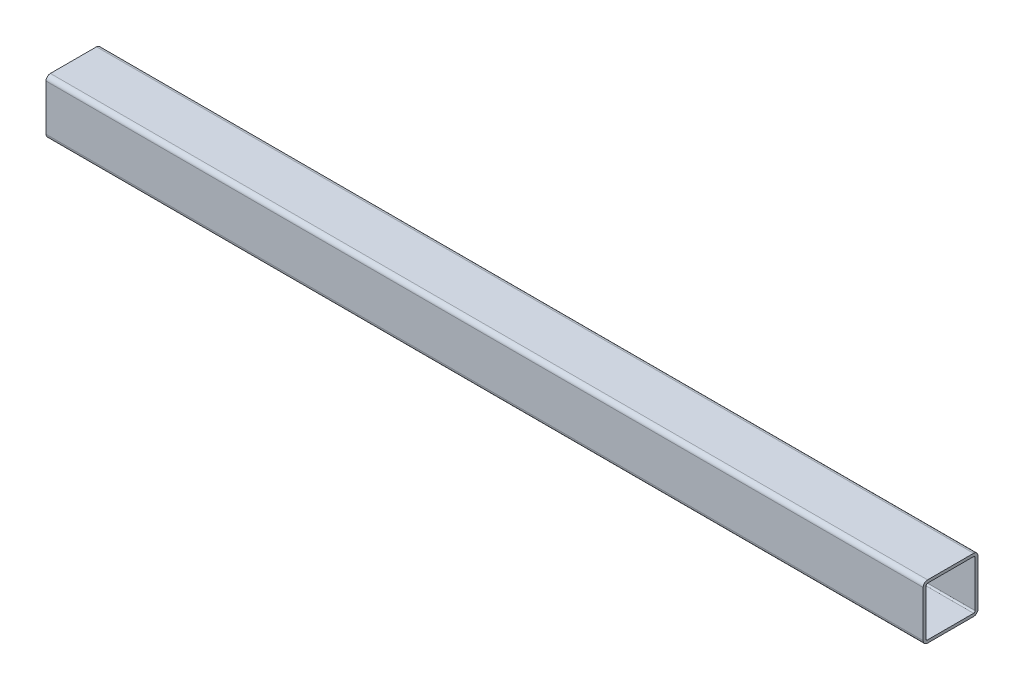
from build123d import *

# Parameters (mm, degrees)
BOSS_EXTRUDE1_DEPTH = 203.2
SCALE1_SCALE_X      = 1
SCALE1_SCALE_Y      = 0.4
SCALE1_SCALE_Z      = 0.4


with BuildPart() as part:
    # Sketch1 → Boss-Extrude1 (new body)
    with BuildSketch(Plane(origin=(0, 0, 0), x_dir=(0, 0, -1), z_dir=(1, 0, 0))):
        with BuildLine():
            Line((0, 2.54), (0, 29.21))
            ThreePointArc((0, 29.21), (-0.743948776, 31.006051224), (-2.54, 31.75))
            Line((-2.54, 31.75), (-29.21, 31.75))
            ThreePointArc((-29.21, 31.75), (-31.006051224, 31.006051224), (-31.75, 29.21))
            Line((-31.75, 29.21), (-31.75, 2.54))
            ThreePointArc((-31.75, 2.54), (-31.006051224, 0.743948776), (-29.21, 0))
            Line((-29.21, 0), (-2.54, 0))
            ThreePointArc((-2.54, 0), (-0.743948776, 0.743948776), (0, 2.54))
        make_face()
        with BuildLine():
            Line((-1.651, 2.54), (-1.651, 29.21))
            ThreePointArc((-1.651, 29.21), (-1.911382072, 29.838617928), (-2.54, 30.099))
            Line((-2.54, 30.099), (-29.21, 30.099))
            ThreePointArc((-29.21, 30.099), (-29.838617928, 29.838617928), (-30.099, 29.21))
            Line((-30.099, 29.21), (-30.099, 2.54))
            ThreePointArc((-30.099, 2.54), (-29.838617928, 1.911382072), (-29.21, 1.651))
            Line((-29.21, 1.651), (-2.54, 1.651))
            ThreePointArc((-2.54, 1.651), (-1.911382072, 1.911382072), (-1.651, 2.54))
        make_face(mode=Mode.SUBTRACT)
    extrude(amount=BOSS_EXTRUDE1_DEPTH)


with BuildPart() as part_1:
    # Scale1: scaled about (101.6, 15.875, 15.875)
    add(part.part.scale((SCALE1_SCALE_X, SCALE1_SCALE_Y, SCALE1_SCALE_Z), about=(101.6, 15.875, 15.875)))


solid = part_1.part
